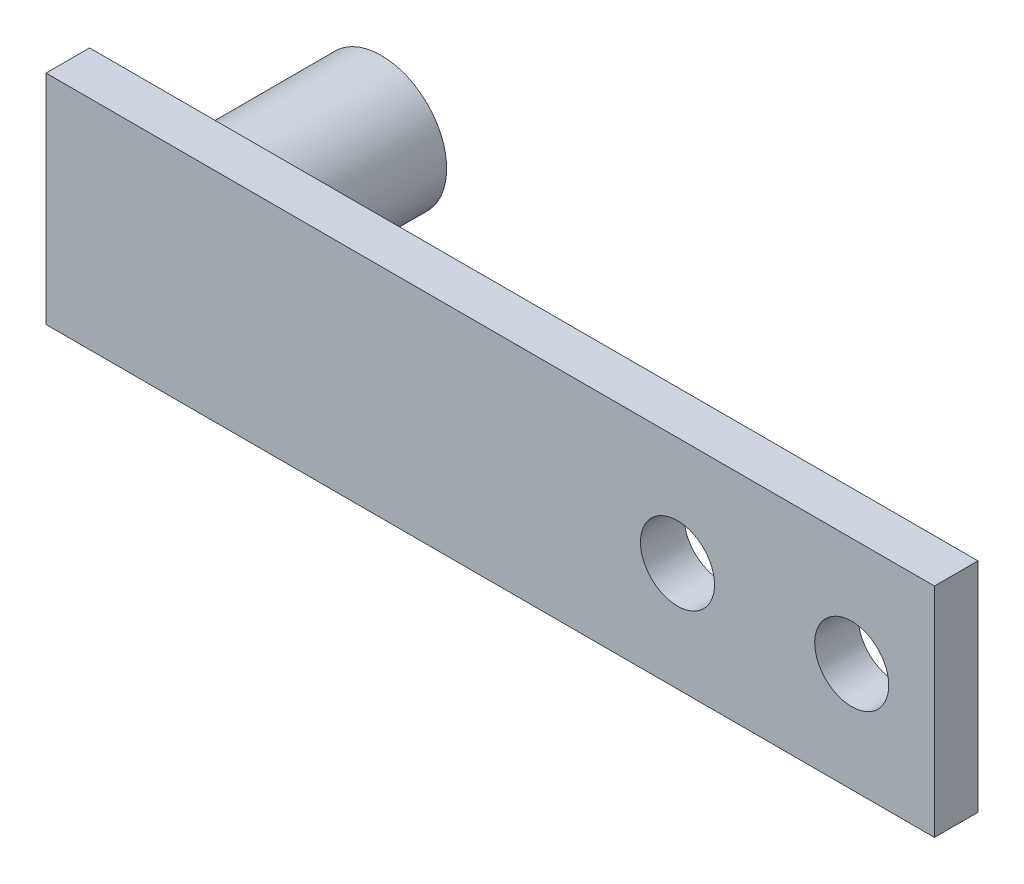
ISO-10303-21;
HEADER;
FILE_DESCRIPTION(('STEP AP214'),'2;1');
FILE_NAME('part.step','',(''),(''),'','','');
FILE_SCHEMA(('AUTOMOTIVE_DESIGN { 1 0 10303 214 1 1 1 1 }'));
ENDSEC;
DATA;
#1=APPLICATION_CONTEXT('core data for automotive mechanical design processes');
#2=APPLICATION_PROTOCOL_DEFINITION('international standard','automotive_design',2000,#1);
#3=PRODUCT_CONTEXT('',#1,'mechanical');
#4=PRODUCT('Part','Part','',(#3));
#5=PRODUCT_RELATED_PRODUCT_CATEGORY('part','',(#4));
#6=PRODUCT_DEFINITION_FORMATION('','',#4);
#7=PRODUCT_DEFINITION_CONTEXT('part definition',#1,'design');
#8=PRODUCT_DEFINITION('design','',#6,#7);
#9=PRODUCT_DEFINITION_SHAPE('','',#8);
#10=(LENGTH_UNIT() NAMED_UNIT(*) SI_UNIT(.MILLI.,.METRE.));
#11=(NAMED_UNIT(*) PLANE_ANGLE_UNIT() SI_UNIT($,.RADIAN.));
#12=(NAMED_UNIT(*) SI_UNIT($,.STERADIAN.) SOLID_ANGLE_UNIT());
#13=UNCERTAINTY_MEASURE_WITH_UNIT(LENGTH_MEASURE(1.E-05),#10,'distance_accuracy_value','');
#14=(GEOMETRIC_REPRESENTATION_CONTEXT(3) GLOBAL_UNCERTAINTY_ASSIGNED_CONTEXT((#13)) GLOBAL_UNIT_ASSIGNED_CONTEXT((#10,
#11,#12)) REPRESENTATION_CONTEXT('',''));
#15=CARTESIAN_POINT('',(0.,0.,0.));
#16=DIRECTION('',(0.,0.,1.));
#17=DIRECTION('',(1.,0.,0.));
#18=AXIS2_PLACEMENT_3D('',#15,#16,#17);
#19=CARTESIAN_POINT('',(7.5,7.5,21.));
#20=DIRECTION('',(0.,-1.,0.));
#21=DIRECTION('',(1.,0.,0.));
#22=AXIS2_PLACEMENT_3D('',#19,#20,#21);
#23=PLANE('',#22);
#24=DIRECTION('',(-1.,0.,0.));
#25=VECTOR('',#24,1.);
#26=CARTESIAN_POINT('',(7.5,7.5,20.));
#27=LINE('',#26,#25);
#28=CARTESIAN_POINT('',(7.5,7.5,20.));
#29=VERTEX_POINT('',#28);
#30=CARTESIAN_POINT('',(0.,7.5,20.));
#31=VERTEX_POINT('',#30);
#32=EDGE_CURVE('E123',#29,#31,#27,.T.);
#33=ORIENTED_EDGE('',*,*,#32,.T.);
#34=CARTESIAN_POINT('',(-7.5,7.5,20.));
#35=VERTEX_POINT('',#34);
#36=EDGE_CURVE('E119',#31,#35,#27,.T.);
#37=ORIENTED_EDGE('',*,*,#36,.T.);
#38=DIRECTION('',(0.,0.,-1.));
#39=VECTOR('',#38,1.);
#40=CARTESIAN_POINT('',(-7.5,7.5,21.));
#41=LINE('',#40,#39);
#42=CARTESIAN_POINT('',(-7.5,7.5,21.));
#43=VERTEX_POINT('',#42);
#44=EDGE_CURVE('E9',#43,#35,#41,.T.);
#45=ORIENTED_EDGE('',*,*,#44,.F.);
#46=DIRECTION('',(-1.,0.,0.));
#47=VECTOR('',#46,1.);
#48=CARTESIAN_POINT('',(7.5,7.5,21.));
#49=LINE('',#48,#47);
#50=CARTESIAN_POINT('',(7.5,7.5,21.));
#51=VERTEX_POINT('',#50);
#52=EDGE_CURVE('E132',#51,#43,#49,.T.);
#53=ORIENTED_EDGE('',*,*,#52,.F.);
#54=DIRECTION('',(0.,0.,-1.));
#55=VECTOR('',#54,1.);
#56=CARTESIAN_POINT('',(7.5,7.5,21.));
#57=LINE('',#56,#55);
#58=EDGE_CURVE('E133',#51,#29,#57,.T.);
#59=ORIENTED_EDGE('',*,*,#58,.T.);
#60=EDGE_LOOP('',(#33,#37,#45,#53,#59));
#61=FACE_BOUND('',#60,.T.);
#62=ADVANCED_FACE('F14',(#61),#23,.F.);
#63=CARTESIAN_POINT('',(-7.5,7.5,21.));
#64=DIRECTION('',(1.,0.,0.));
#65=DIRECTION('',(0.,0.,1.));
#66=AXIS2_PLACEMENT_3D('',#63,#64,#65);
#67=PLANE('',#66);
#68=DIRECTION('',(0.,-1.,0.));
#69=VECTOR('',#68,1.);
#70=CARTESIAN_POINT('',(-7.5,7.5,20.));
#71=LINE('',#70,#69);
#72=CARTESIAN_POINT('',(-7.5,0.,20.));
#73=VERTEX_POINT('',#72);
#74=EDGE_CURVE('E117',#35,#73,#71,.T.);
#75=ORIENTED_EDGE('',*,*,#74,.T.);
#76=DIRECTION('',(0.,1.,0.));
#77=VECTOR('',#76,1.);
#78=CARTESIAN_POINT('',(-7.5,7.5,20.));
#79=LINE('',#78,#77);
#80=CARTESIAN_POINT('',(-7.5,-7.5,20.));
#81=VERTEX_POINT('',#80);
#82=EDGE_CURVE('E95',#81,#73,#79,.T.);
#83=ORIENTED_EDGE('',*,*,#82,.F.);
#84=DIRECTION('',(0.,0.,-1.));
#85=VECTOR('',#84,1.);
#86=CARTESIAN_POINT('',(-7.5,-7.5,21.));
#87=LINE('',#86,#85);
#88=CARTESIAN_POINT('',(-7.5,-7.5,21.));
#89=VERTEX_POINT('',#88);
#90=EDGE_CURVE('E22',#89,#81,#87,.T.);
#91=ORIENTED_EDGE('',*,*,#90,.F.);
#92=DIRECTION('',(0.,-1.,0.));
#93=VECTOR('',#92,1.);
#94=CARTESIAN_POINT('',(-7.5,7.5,21.));
#95=LINE('',#94,#93);
#96=EDGE_CURVE('E142',#43,#89,#95,.T.);
#97=ORIENTED_EDGE('',*,*,#96,.F.);
#98=ORIENTED_EDGE('',*,*,#44,.T.);
#99=EDGE_LOOP('',(#75,#83,#91,#97,#98));
#100=FACE_BOUND('',#99,.T.);
#101=ADVANCED_FACE('F121',(#100),#67,.F.);
#102=CARTESIAN_POINT('',(7.5,-7.5,21.));
#103=DIRECTION('',(0.,1.,0.));
#104=DIRECTION('',(-1.,0.,0.));
#105=AXIS2_PLACEMENT_3D('',#102,#103,#104);
#106=PLANE('',#105);
#107=DIRECTION('',(1.,0.,0.));
#108=VECTOR('',#107,1.);
#109=CARTESIAN_POINT('',(7.5,-7.5,20.));
#110=LINE('',#109,#108);
#111=CARTESIAN_POINT('',(0.,-7.5,20.));
#112=VERTEX_POINT('',#111);
#113=EDGE_CURVE('E100',#81,#112,#110,.T.);
#114=ORIENTED_EDGE('',*,*,#113,.T.);
#115=DIRECTION('',(-1.,0.,0.));
#116=VECTOR('',#115,1.);
#117=CARTESIAN_POINT('',(7.5,-7.5,20.));
#118=LINE('',#117,#116);
#119=CARTESIAN_POINT('',(7.5,-7.5,20.));
#120=VERTEX_POINT('',#119);
#121=EDGE_CURVE('E105',#120,#112,#118,.T.);
#122=ORIENTED_EDGE('',*,*,#121,.F.);
#123=DIRECTION('',(0.,0.,-1.));
#124=VECTOR('',#123,1.);
#125=CARTESIAN_POINT('',(7.5,-7.5,21.));
#126=LINE('',#125,#124);
#127=CARTESIAN_POINT('',(7.5,-7.5,21.));
#128=VERTEX_POINT('',#127);
#129=EDGE_CURVE('E37',#128,#120,#126,.T.);
#130=ORIENTED_EDGE('',*,*,#129,.F.);
#131=DIRECTION('',(1.,0.,0.));
#132=VECTOR('',#131,1.);
#133=CARTESIAN_POINT('',(7.5,-7.5,21.));
#134=LINE('',#133,#132);
#135=EDGE_CURVE('E140',#89,#128,#134,.T.);
#136=ORIENTED_EDGE('',*,*,#135,.F.);
#137=ORIENTED_EDGE('',*,*,#90,.T.);
#138=EDGE_LOOP('',(#114,#122,#130,#136,#137));
#139=FACE_BOUND('',#138,.T.);
#140=ADVANCED_FACE('F138',(#139),#106,.F.);
#141=CARTESIAN_POINT('',(7.5,7.5,21.));
#142=DIRECTION('',(-1.,0.,0.));
#143=DIRECTION('',(0.,0.,-1.));
#144=AXIS2_PLACEMENT_3D('',#141,#142,#143);
#145=PLANE('',#144);
#146=DIRECTION('',(0.,1.,0.));
#147=VECTOR('',#146,1.);
#148=CARTESIAN_POINT('',(7.5,7.5,20.));
#149=LINE('',#148,#147);
#150=CARTESIAN_POINT('',(7.5,0.,20.));
#151=VERTEX_POINT('',#150);
#152=EDGE_CURVE('E125',#120,#151,#149,.T.);
#153=ORIENTED_EDGE('',*,*,#152,.T.);
#154=DIRECTION('',(0.,-1.,0.));
#155=VECTOR('',#154,1.);
#156=CARTESIAN_POINT('',(7.5,7.5,20.));
#157=LINE('',#156,#155);
#158=EDGE_CURVE('E120',#29,#151,#157,.T.);
#159=ORIENTED_EDGE('',*,*,#158,.F.);
#160=ORIENTED_EDGE('',*,*,#58,.F.);
#161=DIRECTION('',(0.,1.,0.));
#162=VECTOR('',#161,1.);
#163=CARTESIAN_POINT('',(7.5,7.5,21.));
#164=LINE('',#163,#162);
#165=EDGE_CURVE('E136',#128,#51,#164,.T.);
#166=ORIENTED_EDGE('',*,*,#165,.F.);
#167=ORIENTED_EDGE('',*,*,#129,.T.);
#168=EDGE_LOOP('',(#153,#159,#160,#166,#167));
#169=FACE_BOUND('',#168,.T.);
#170=ADVANCED_FACE('F220',(#169),#145,.F.);
#171=CARTESIAN_POINT('',(-12.5,12.5,21.));
#172=DIRECTION('',(0.,0.,1.));
#173=DIRECTION('',(0.,-1.,0.));
#174=AXIS2_PLACEMENT_3D('',#171,#172,#173);
#175=PLANE('',#174);
#176=CARTESIAN_POINT('',(60.,0.,21.));
#177=DIRECTION('',(0.,0.,1.));
#178=DIRECTION('',(0.,-1.,0.));
#179=AXIS2_PLACEMENT_3D('',#176,#177,#178);
#180=CIRCLE('',#179,4.25);
#181=CARTESIAN_POINT('',(60.,-4.25,21.));
#182=VERTEX_POINT('',#181);
#183=EDGE_CURVE('E186',#182,#182,#180,.T.);
#184=ORIENTED_EDGE('',*,*,#183,.T.);
#185=EDGE_LOOP('',(#184));
#186=FACE_BOUND('',#185,.T.);
#187=CARTESIAN_POINT('',(80.,0.,21.));
#188=DIRECTION('',(0.,0.,1.));
#189=DIRECTION('',(0.,-1.,0.));
#190=AXIS2_PLACEMENT_3D('',#187,#188,#189);
#191=CIRCLE('',#190,4.25);
#192=CARTESIAN_POINT('',(80.,-4.25,21.));
#193=VERTEX_POINT('',#192);
#194=EDGE_CURVE('E17',#193,#193,#191,.T.);
#195=ORIENTED_EDGE('',*,*,#194,.T.);
#196=EDGE_LOOP('',(#195));
#197=FACE_BOUND('',#196,.T.);
#198=DIRECTION('',(-1.,0.,0.));
#199=VECTOR('',#198,1.);
#200=CARTESIAN_POINT('',(89.5,12.5,21.));
#201=LINE('',#200,#199);
#202=CARTESIAN_POINT('',(89.5,12.5,21.));
#203=VERTEX_POINT('',#202);
#204=CARTESIAN_POINT('',(-12.5,12.5,21.));
#205=VERTEX_POINT('',#204);
#206=EDGE_CURVE('E173',#203,#205,#201,.T.);
#207=ORIENTED_EDGE('',*,*,#206,.F.);
#208=DIRECTION('',(0.,1.,0.));
#209=VECTOR('',#208,1.);
#210=CARTESIAN_POINT('',(89.5,12.5,21.));
#211=LINE('',#210,#209);
#212=CARTESIAN_POINT('',(89.5,-12.5,21.));
#213=VERTEX_POINT('',#212);
#214=EDGE_CURVE('E166',#213,#203,#211,.T.);
#215=ORIENTED_EDGE('',*,*,#214,.F.);
#216=DIRECTION('',(1.,0.,0.));
#217=VECTOR('',#216,1.);
#218=CARTESIAN_POINT('',(89.5,-12.5,21.));
#219=LINE('',#218,#217);
#220=CARTESIAN_POINT('',(-12.5,-12.5,21.));
#221=VERTEX_POINT('',#220);
#222=EDGE_CURVE('E169',#221,#213,#219,.T.);
#223=ORIENTED_EDGE('',*,*,#222,.F.);
#224=DIRECTION('',(0.,-1.,0.));
#225=VECTOR('',#224,1.);
#226=CARTESIAN_POINT('',(-12.5,12.5,21.));
#227=LINE('',#226,#225);
#228=EDGE_CURVE('E171',#205,#221,#227,.T.);
#229=ORIENTED_EDGE('',*,*,#228,.F.);
#230=EDGE_LOOP('',(#207,#215,#223,#229));
#231=FACE_BOUND('',#230,.T.);
#232=ORIENTED_EDGE('',*,*,#165,.T.);
#233=ORIENTED_EDGE('',*,*,#52,.T.);
#234=ORIENTED_EDGE('',*,*,#96,.T.);
#235=ORIENTED_EDGE('',*,*,#135,.T.);
#236=EDGE_LOOP('',(#232,#233,#234,#235));
#237=FACE_BOUND('',#236,.T.);
#238=ADVANCED_FACE('F149',(#186,#197,#231,#237),#175,.F.);
#239=CARTESIAN_POINT('',(89.5,12.5,26.));
#240=DIRECTION('',(0.,-1.,0.));
#241=DIRECTION('',(1.,0.,0.));
#242=AXIS2_PLACEMENT_3D('',#239,#240,#241);
#243=PLANE('',#242);
#244=ORIENTED_EDGE('',*,*,#206,.T.);
#245=DIRECTION('',(0.,0.,-1.));
#246=VECTOR('',#245,1.);
#247=CARTESIAN_POINT('',(-12.5,12.5,26.));
#248=LINE('',#247,#246);
#249=CARTESIAN_POINT('',(-12.5,12.5,26.));
#250=VERTEX_POINT('',#249);
#251=EDGE_CURVE('E152',#250,#205,#248,.T.);
#252=ORIENTED_EDGE('',*,*,#251,.F.);
#253=DIRECTION('',(-1.,0.,0.));
#254=VECTOR('',#253,1.);
#255=CARTESIAN_POINT('',(89.5,12.5,26.));
#256=LINE('',#255,#254);
#257=CARTESIAN_POINT('',(89.5,12.5,26.));
#258=VERTEX_POINT('',#257);
#259=EDGE_CURVE('E168',#258,#250,#256,.T.);
#260=ORIENTED_EDGE('',*,*,#259,.F.);
#261=DIRECTION('',(0.,0.,-1.));
#262=VECTOR('',#261,1.);
#263=CARTESIAN_POINT('',(89.5,12.5,26.));
#264=LINE('',#263,#262);
#265=EDGE_CURVE('E162',#258,#203,#264,.T.);
#266=ORIENTED_EDGE('',*,*,#265,.T.);
#267=EDGE_LOOP('',(#244,#252,#260,#266));
#268=FACE_BOUND('',#267,.T.);
#269=ADVANCED_FACE('F226',(#268),#243,.F.);
#270=CARTESIAN_POINT('',(-12.5,12.5,26.));
#271=DIRECTION('',(1.,0.,0.));
#272=DIRECTION('',(0.,0.,1.));
#273=AXIS2_PLACEMENT_3D('',#270,#271,#272);
#274=PLANE('',#273);
#275=ORIENTED_EDGE('',*,*,#228,.T.);
#276=DIRECTION('',(0.,0.,-1.));
#277=VECTOR('',#276,1.);
#278=CARTESIAN_POINT('',(-12.5,-12.5,26.));
#279=LINE('',#278,#277);
#280=CARTESIAN_POINT('',(-12.5,-12.5,26.));
#281=VERTEX_POINT('',#280);
#282=EDGE_CURVE('E156',#281,#221,#279,.T.);
#283=ORIENTED_EDGE('',*,*,#282,.F.);
#284=DIRECTION('',(0.,-1.,0.));
#285=VECTOR('',#284,1.);
#286=CARTESIAN_POINT('',(-12.5,12.5,26.));
#287=LINE('',#286,#285);
#288=EDGE_CURVE('E179',#250,#281,#287,.T.);
#289=ORIENTED_EDGE('',*,*,#288,.F.);
#290=ORIENTED_EDGE('',*,*,#251,.T.);
#291=EDGE_LOOP('',(#275,#283,#289,#290));
#292=FACE_BOUND('',#291,.T.);
#293=ADVANCED_FACE('F229',(#292),#274,.F.);
#294=CARTESIAN_POINT('',(89.5,-12.5,26.));
#295=DIRECTION('',(0.,1.,0.));
#296=DIRECTION('',(-1.,0.,0.));
#297=AXIS2_PLACEMENT_3D('',#294,#295,#296);
#298=PLANE('',#297);
#299=ORIENTED_EDGE('',*,*,#222,.T.);
#300=DIRECTION('',(0.,0.,-1.));
#301=VECTOR('',#300,1.);
#302=CARTESIAN_POINT('',(89.5,-12.5,26.));
#303=LINE('',#302,#301);
#304=CARTESIAN_POINT('',(89.5,-12.5,26.));
#305=VERTEX_POINT('',#304);
#306=EDGE_CURVE('E159',#305,#213,#303,.T.);
#307=ORIENTED_EDGE('',*,*,#306,.F.);
#308=DIRECTION('',(1.,0.,0.));
#309=VECTOR('',#308,1.);
#310=CARTESIAN_POINT('',(89.5,-12.5,26.));
#311=LINE('',#310,#309);
#312=EDGE_CURVE('E177',#281,#305,#311,.T.);
#313=ORIENTED_EDGE('',*,*,#312,.F.);
#314=ORIENTED_EDGE('',*,*,#282,.T.);
#315=EDGE_LOOP('',(#299,#307,#313,#314));
#316=FACE_BOUND('',#315,.T.);
#317=ADVANCED_FACE('F233',(#316),#298,.F.);
#318=CARTESIAN_POINT('',(89.5,12.5,26.));
#319=DIRECTION('',(-1.,0.,0.));
#320=DIRECTION('',(0.,0.,-1.));
#321=AXIS2_PLACEMENT_3D('',#318,#319,#320);
#322=PLANE('',#321);
#323=ORIENTED_EDGE('',*,*,#214,.T.);
#324=ORIENTED_EDGE('',*,*,#265,.F.);
#325=DIRECTION('',(0.,1.,0.));
#326=VECTOR('',#325,1.);
#327=CARTESIAN_POINT('',(89.5,12.5,26.));
#328=LINE('',#327,#326);
#329=EDGE_CURVE('E165',#305,#258,#328,.T.);
#330=ORIENTED_EDGE('',*,*,#329,.F.);
#331=ORIENTED_EDGE('',*,*,#306,.T.);
#332=EDGE_LOOP('',(#323,#324,#330,#331));
#333=FACE_BOUND('',#332,.T.);
#334=ADVANCED_FACE('F237',(#333),#322,.F.);
#335=CARTESIAN_POINT('',(-12.5,12.5,26.));
#336=DIRECTION('',(0.,0.,1.));
#337=DIRECTION('',(0.,-1.,0.));
#338=AXIS2_PLACEMENT_3D('',#335,#336,#337);
#339=PLANE('',#338);
#340=CARTESIAN_POINT('',(60.,0.,26.));
#341=DIRECTION('',(0.,0.,1.));
#342=DIRECTION('',(0.,-1.,0.));
#343=AXIS2_PLACEMENT_3D('',#340,#341,#342);
#344=CIRCLE('',#343,4.25);
#345=CARTESIAN_POINT('',(60.,-4.25,26.));
#346=VERTEX_POINT('',#345);
#347=EDGE_CURVE('E104',#346,#346,#344,.T.);
#348=ORIENTED_EDGE('',*,*,#347,.F.);
#349=EDGE_LOOP('',(#348));
#350=FACE_BOUND('',#349,.T.);
#351=CARTESIAN_POINT('',(80.,0.,26.));
#352=DIRECTION('',(0.,0.,1.));
#353=DIRECTION('',(0.,-1.,0.));
#354=AXIS2_PLACEMENT_3D('',#351,#352,#353);
#355=CIRCLE('',#354,4.25);
#356=CARTESIAN_POINT('',(80.,-4.25,26.));
#357=VERTEX_POINT('',#356);
#358=EDGE_CURVE('E183',#357,#357,#355,.T.);
#359=ORIENTED_EDGE('',*,*,#358,.F.);
#360=EDGE_LOOP('',(#359));
#361=FACE_BOUND('',#360,.T.);
#362=ORIENTED_EDGE('',*,*,#259,.T.);
#363=ORIENTED_EDGE('',*,*,#288,.T.);
#364=ORIENTED_EDGE('',*,*,#312,.T.);
#365=ORIENTED_EDGE('',*,*,#329,.T.);
#366=EDGE_LOOP('',(#362,#363,#364,#365));
#367=FACE_BOUND('',#366,.T.);
#368=ADVANCED_FACE('F241',(#350,#361,#367),#339,.T.);
#369=CARTESIAN_POINT('',(80.,0.,26.));
#370=DIRECTION('',(0.,0.,1.));
#371=DIRECTION('',(0.,-1.,0.));
#372=AXIS2_PLACEMENT_3D('',#369,#370,#371);
#373=CYLINDRICAL_SURFACE('',#372,4.25);
#374=ORIENTED_EDGE('',*,*,#358,.T.);
#375=EDGE_LOOP('',(#374));
#376=FACE_BOUND('',#375,.T.);
#377=ORIENTED_EDGE('',*,*,#194,.F.);
#378=EDGE_LOOP('',(#377));
#379=FACE_BOUND('',#378,.T.);
#380=ADVANCED_FACE('F248',(#376,#379),#373,.F.);
#381=CARTESIAN_POINT('',(60.,0.,26.));
#382=DIRECTION('',(0.,0.,1.));
#383=DIRECTION('',(0.,-1.,0.));
#384=AXIS2_PLACEMENT_3D('',#381,#382,#383);
#385=CYLINDRICAL_SURFACE('',#384,4.25);
#386=ORIENTED_EDGE('',*,*,#347,.T.);
#387=EDGE_LOOP('',(#386));
#388=FACE_BOUND('',#387,.T.);
#389=ORIENTED_EDGE('',*,*,#183,.F.);
#390=EDGE_LOOP('',(#389));
#391=FACE_BOUND('',#390,.T.);
#392=ADVANCED_FACE('F252',(#388,#391),#385,.F.);
#393=CARTESIAN_POINT('',(0.,0.,20.));
#394=DIRECTION('',(0.,0.,-1.));
#395=DIRECTION('',(-1.,0.,0.));
#396=AXIS2_PLACEMENT_3D('',#393,#394,#395);
#397=PLANE('',#396);
#398=ORIENTED_EDGE('',*,*,#82,.T.);
#399=CARTESIAN_POINT('',(0.,0.,20.));
#400=DIRECTION('',(0.,0.,-1.));
#401=DIRECTION('',(-1.,0.,0.));
#402=AXIS2_PLACEMENT_3D('',#399,#400,#401);
#403=CIRCLE('',#402,7.5);
#404=EDGE_CURVE('E98',#112,#73,#403,.T.);
#405=ORIENTED_EDGE('',*,*,#404,.F.);
#406=ORIENTED_EDGE('',*,*,#113,.F.);
#407=EDGE_LOOP('',(#398,#405,#406));
#408=FACE_BOUND('',#407,.T.);
#409=ADVANCED_FACE('F97',(#408),#397,.T.);
#410=ORIENTED_EDGE('',*,*,#74,.F.);
#411=ORIENTED_EDGE('',*,*,#36,.F.);
#412=EDGE_CURVE('E110',#73,#31,#403,.T.);
#413=ORIENTED_EDGE('',*,*,#412,.F.);
#414=EDGE_LOOP('',(#410,#411,#413));
#415=FACE_BOUND('',#414,.T.);
#416=ADVANCED_FACE('F116',(#415),#397,.T.);
#417=ORIENTED_EDGE('',*,*,#32,.F.);
#418=ORIENTED_EDGE('',*,*,#158,.T.);
#419=EDGE_CURVE('E29',#31,#151,#403,.T.);
#420=ORIENTED_EDGE('',*,*,#419,.F.);
#421=EDGE_LOOP('',(#417,#418,#420));
#422=FACE_BOUND('',#421,.T.);
#423=ADVANCED_FACE('F208',(#422),#397,.T.);
#424=ORIENTED_EDGE('',*,*,#121,.T.);
#425=EDGE_CURVE('E112',#151,#112,#403,.T.);
#426=ORIENTED_EDGE('',*,*,#425,.F.);
#427=ORIENTED_EDGE('',*,*,#152,.F.);
#428=EDGE_LOOP('',(#424,#426,#427));
#429=FACE_BOUND('',#428,.T.);
#430=ADVANCED_FACE('F199',(#429),#397,.T.);
#431=CARTESIAN_POINT('',(0.,0.,20.));
#432=DIRECTION('',(0.,0.,-1.));
#433=DIRECTION('',(-1.,0.,0.));
#434=AXIS2_PLACEMENT_3D('',#431,#432,#433);
#435=CYLINDRICAL_SURFACE('',#434,7.5);
#436=ORIENTED_EDGE('',*,*,#412,.T.);
#437=ORIENTED_EDGE('',*,*,#419,.T.);
#438=ORIENTED_EDGE('',*,*,#425,.T.);
#439=ORIENTED_EDGE('',*,*,#404,.T.);
#440=EDGE_LOOP('',(#436,#437,#438,#439));
#441=FACE_BOUND('',#440,.T.);
#442=CARTESIAN_POINT('',(0.,0.,0.));
#443=DIRECTION('',(0.,0.,-1.));
#444=DIRECTION('',(-1.,0.,0.));
#445=AXIS2_PLACEMENT_3D('',#442,#443,#444);
#446=CIRCLE('',#445,7.5);
#447=CARTESIAN_POINT('',(-7.5,0.,0.));
#448=VERTEX_POINT('',#447);
#449=EDGE_CURVE('E113',#448,#448,#446,.T.);
#450=ORIENTED_EDGE('',*,*,#449,.F.);
#451=EDGE_LOOP('',(#450));
#452=FACE_BOUND('',#451,.T.);
#453=ADVANCED_FACE('F108',(#441,#452),#435,.T.);
#454=CARTESIAN_POINT('',(0.,0.,0.));
#455=DIRECTION('',(0.,0.,-1.));
#456=DIRECTION('',(-1.,0.,0.));
#457=AXIS2_PLACEMENT_3D('',#454,#455,#456);
#458=PLANE('',#457);
#459=ORIENTED_EDGE('',*,*,#449,.T.);
#460=EDGE_LOOP('',(#459));
#461=FACE_BOUND('',#460,.T.);
#462=ADVANCED_FACE('F197',(#461),#458,.T.);
#463=CLOSED_SHELL('',(#62,#101,#140,#170,#238,#269,#293,#317,#334,#368,#380,#392,#409,#416,#423,
#430,#453,#462));
#464=MANIFOLD_SOLID_BREP('B1',#463);
#465=ADVANCED_BREP_SHAPE_REPRESENTATION('',(#18,#464),#14);
#466=SHAPE_DEFINITION_REPRESENTATION(#9,#465);
ENDSEC;
END-ISO-10303-21;
